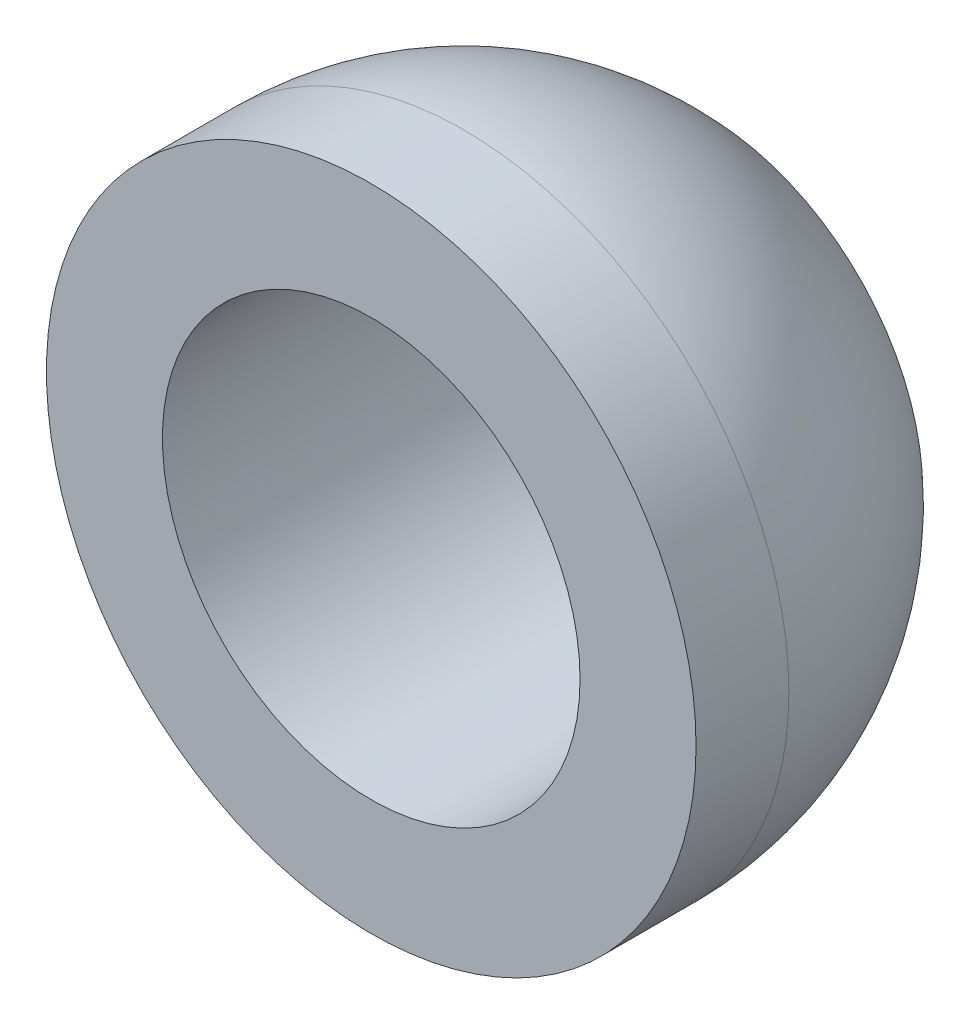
from build123d import *

# Parameters (mm, degrees)
ESQUISSE2_R             = 2.433344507
ENL_V_MAT_EXTRU_1_DEPTH = 1


with BuildPart() as part:
    # Esquisse1 → R_volution1 (revolve)
    with BuildSketch(Plane(origin=(0, 0, 0), x_dir=(0, 0, -1), z_dir=(1, 0, 0)), mode=Mode.PRIVATE) as r_volution1_sk:
        with BuildLine():
            Line((0, 2.25), (3.680951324, 2.25))
            ThreePointArc((3.680951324, 2.25), (2.479019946, 3.172144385), (1, 3.5))
            Line((1, 3.5), (0, 3.5))
            Line((0, 3.5), (0, 2.25))
        make_face()
    revolve(r_volution1_sk.sketch.rotate(Axis((0, 0, 0), (0, 0, -1)), 90), axis=Axis((0, 0, 0), (0, 0, -1)))

    # Esquisse2 → Enl_v. mat.-Extru.1 (cut)
    with BuildSketch(Plane.XY.offset(-3.6)):
        Circle(ESQUISSE2_R)
    extrude(amount=-ENL_V_MAT_EXTRU_1_DEPTH, mode=Mode.SUBTRACT)


solid = part.part
